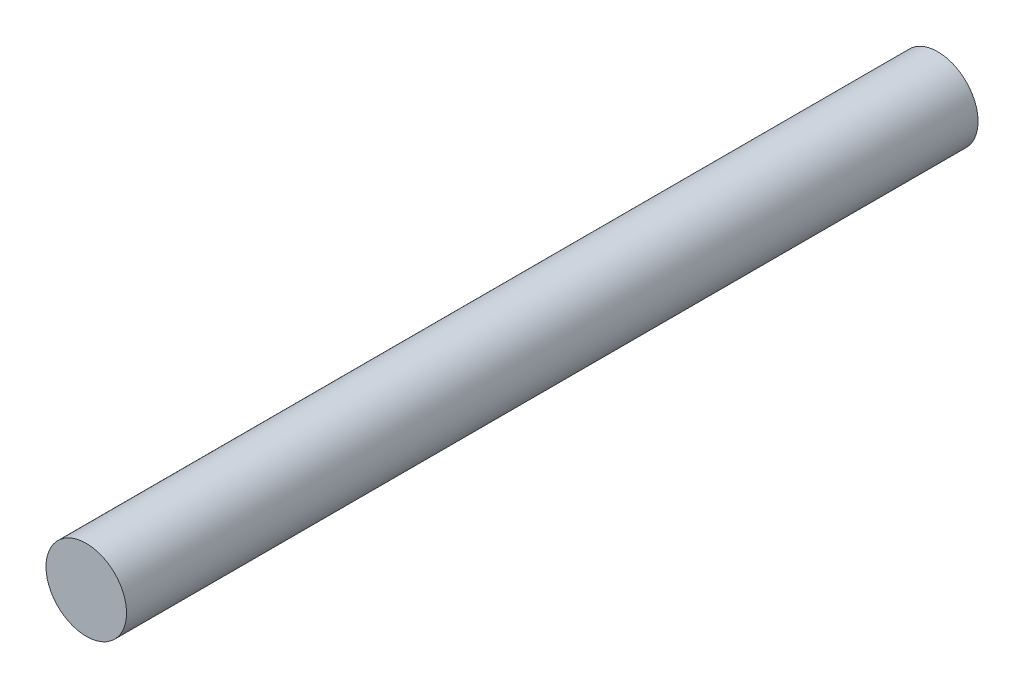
ISO-10303-21;
HEADER;
FILE_DESCRIPTION(('STEP AP214'),'2;1');
FILE_NAME('part.step','',(''),(''),'','','');
FILE_SCHEMA(('AUTOMOTIVE_DESIGN { 1 0 10303 214 1 1 1 1 }'));
ENDSEC;
DATA;
#1=APPLICATION_CONTEXT('core data for automotive mechanical design processes');
#2=APPLICATION_PROTOCOL_DEFINITION('international standard','automotive_design',2000,#1);
#3=PRODUCT_CONTEXT('',#1,'mechanical');
#4=PRODUCT('Part','Part','',(#3));
#5=PRODUCT_RELATED_PRODUCT_CATEGORY('part','',(#4));
#6=PRODUCT_DEFINITION_FORMATION('','',#4);
#7=PRODUCT_DEFINITION_CONTEXT('part definition',#1,'design');
#8=PRODUCT_DEFINITION('design','',#6,#7);
#9=PRODUCT_DEFINITION_SHAPE('','',#8);
#10=(LENGTH_UNIT() NAMED_UNIT(*) SI_UNIT(.MILLI.,.METRE.));
#11=(NAMED_UNIT(*) PLANE_ANGLE_UNIT() SI_UNIT($,.RADIAN.));
#12=(NAMED_UNIT(*) SI_UNIT($,.STERADIAN.) SOLID_ANGLE_UNIT());
#13=UNCERTAINTY_MEASURE_WITH_UNIT(LENGTH_MEASURE(1.E-05),#10,'distance_accuracy_value','');
#14=(GEOMETRIC_REPRESENTATION_CONTEXT(3) GLOBAL_UNCERTAINTY_ASSIGNED_CONTEXT((#13)) GLOBAL_UNIT_ASSIGNED_CONTEXT((#10,
#11,#12)) REPRESENTATION_CONTEXT('',''));
#15=CARTESIAN_POINT('',(0.,0.,0.));
#16=DIRECTION('',(0.,0.,1.));
#17=DIRECTION('',(1.,0.,0.));
#18=AXIS2_PLACEMENT_3D('',#15,#16,#17);
#19=CARTESIAN_POINT('',(0.,0.,60.96));
#20=DIRECTION('',(0.,0.,-1.));
#21=DIRECTION('',(-1.,0.,0.));
#22=AXIS2_PLACEMENT_3D('',#19,#20,#21);
#23=CYLINDRICAL_SURFACE('',#22,2.8829);
#24=CARTESIAN_POINT('',(0.,0.,60.96));
#25=DIRECTION('',(0.,0.,1.));
#26=DIRECTION('',(1.,0.,0.));
#27=AXIS2_PLACEMENT_3D('',#24,#25,#26);
#28=CIRCLE('',#27,2.8829);
#29=CARTESIAN_POINT('',(-2.8829,0.,60.96));
#30=VERTEX_POINT('',#29);
#31=EDGE_CURVE('E10',#30,#30,#28,.T.);
#32=CARTESIAN_POINT('',(0.,0.,0.));
#33=DIRECTION('',(0.,0.,1.));
#34=DIRECTION('',(1.,0.,0.));
#35=AXIS2_PLACEMENT_3D('',#32,#33,#34);
#36=CIRCLE('',#35,2.8829);
#37=CARTESIAN_POINT('',(-2.8829,0.,0.));
#38=VERTEX_POINT('',#37);
#39=EDGE_CURVE('E38',#38,#38,#36,.T.);
#40=CARTESIAN_POINT('',(-2.8829,0.,60.96));
#41=CARTESIAN_POINT('',(-2.8829,0.,60.325));
#42=CARTESIAN_POINT('',(-2.8829,0.,59.69));
#43=CARTESIAN_POINT('',(-2.8829,0.,58.42));
#44=CARTESIAN_POINT('',(-2.8829,0.,57.785));
#45=CARTESIAN_POINT('',(-2.8829,0.,56.515));
#46=CARTESIAN_POINT('',(-2.8829,0.,55.88));
#47=CARTESIAN_POINT('',(-2.8829,0.,54.61));
#48=CARTESIAN_POINT('',(-2.8829,0.,53.975));
#49=CARTESIAN_POINT('',(-2.8829,0.,52.705));
#50=CARTESIAN_POINT('',(-2.8829,0.,52.07));
#51=CARTESIAN_POINT('',(-2.8829,0.,50.8));
#52=CARTESIAN_POINT('',(-2.8829,0.,50.165));
#53=CARTESIAN_POINT('',(-2.8829,0.,48.895));
#54=CARTESIAN_POINT('',(-2.8829,0.,48.26));
#55=CARTESIAN_POINT('',(-2.8829,0.,46.99));
#56=CARTESIAN_POINT('',(-2.8829,0.,46.355));
#57=CARTESIAN_POINT('',(-2.8829,0.,45.085));
#58=CARTESIAN_POINT('',(-2.8829,0.,44.45));
#59=CARTESIAN_POINT('',(-2.8829,0.,43.18));
#60=CARTESIAN_POINT('',(-2.8829,0.,42.545));
#61=CARTESIAN_POINT('',(-2.8829,0.,41.275));
#62=CARTESIAN_POINT('',(-2.8829,0.,40.64));
#63=CARTESIAN_POINT('',(-2.8829,0.,39.37));
#64=CARTESIAN_POINT('',(-2.8829,0.,38.735));
#65=CARTESIAN_POINT('',(-2.8829,0.,37.465));
#66=CARTESIAN_POINT('',(-2.8829,0.,36.83));
#67=CARTESIAN_POINT('',(-2.8829,0.,35.56));
#68=CARTESIAN_POINT('',(-2.8829,0.,34.925));
#69=CARTESIAN_POINT('',(-2.8829,0.,33.655));
#70=CARTESIAN_POINT('',(-2.8829,0.,33.02));
#71=CARTESIAN_POINT('',(-2.8829,0.,31.75));
#72=CARTESIAN_POINT('',(-2.8829,0.,31.115));
#73=CARTESIAN_POINT('',(-2.8829,0.,29.845));
#74=CARTESIAN_POINT('',(-2.8829,0.,29.21));
#75=CARTESIAN_POINT('',(-2.8829,0.,27.94));
#76=CARTESIAN_POINT('',(-2.8829,0.,27.305));
#77=CARTESIAN_POINT('',(-2.8829,0.,26.035));
#78=CARTESIAN_POINT('',(-2.8829,0.,25.4));
#79=CARTESIAN_POINT('',(-2.8829,0.,24.13));
#80=CARTESIAN_POINT('',(-2.8829,0.,23.495));
#81=CARTESIAN_POINT('',(-2.8829,0.,22.225));
#82=CARTESIAN_POINT('',(-2.8829,0.,21.59));
#83=CARTESIAN_POINT('',(-2.8829,0.,20.32));
#84=CARTESIAN_POINT('',(-2.8829,0.,19.685));
#85=CARTESIAN_POINT('',(-2.8829,0.,18.415));
#86=CARTESIAN_POINT('',(-2.8829,0.,17.78));
#87=CARTESIAN_POINT('',(-2.8829,0.,16.51));
#88=CARTESIAN_POINT('',(-2.8829,0.,15.875));
#89=CARTESIAN_POINT('',(-2.8829,0.,14.605));
#90=CARTESIAN_POINT('',(-2.8829,0.,13.97));
#91=CARTESIAN_POINT('',(-2.8829,0.,12.7));
#92=CARTESIAN_POINT('',(-2.8829,0.,12.065));
#93=CARTESIAN_POINT('',(-2.8829,0.,10.795));
#94=CARTESIAN_POINT('',(-2.8829,0.,10.16));
#95=CARTESIAN_POINT('',(-2.8829,0.,8.89));
#96=CARTESIAN_POINT('',(-2.8829,0.,8.255));
#97=CARTESIAN_POINT('',(-2.8829,0.,6.985));
#98=CARTESIAN_POINT('',(-2.8829,0.,6.35));
#99=CARTESIAN_POINT('',(-2.8829,0.,5.08));
#100=CARTESIAN_POINT('',(-2.8829,0.,4.445));
#101=CARTESIAN_POINT('',(-2.8829,0.,3.175));
#102=CARTESIAN_POINT('',(-2.8829,0.,2.54));
#103=CARTESIAN_POINT('',(-2.8829,0.,1.27));
#104=CARTESIAN_POINT('',(-2.8829,0.,0.634999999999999));
#105=CARTESIAN_POINT('',(-2.8829,0.,0.));
#106=B_SPLINE_CURVE_WITH_KNOTS('',3,(#40,#41,#42,#43,#44,#45,#46,#47,#48,#49,#50,#51,#52,#53,
#54,#55,#56,#57,#58,#59,#60,#61,#62,#63,#64,#65,#66,#67,#68,#69,#70,#71,#72,#73,#74,#75,#76,#77,
#78,#79,#80,#81,#82,#83,#84,#85,#86,#87,#88,#89,#90,#91,#92,#93,#94,#95,#96,#97,#98,#99,#100,
#101,#102,#103,#104,#105),.UNSPECIFIED.,.F.,.F.,(4,2,2,2,2,2,2,2,2,2,2,2,2,2,2,2,2,2,2,2,2,2,2,
2,2,2,2,2,2,2,2,2,4),(0.,1.905,3.80999999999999,5.715,7.61999999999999,9.52499999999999,11.43,
13.335,15.24,17.145,19.05,20.955,22.86,24.765,26.67,28.575,30.48,32.385,34.29,36.195,38.1,
40.005,41.91,43.815,45.72,47.625,49.53,51.435,53.34,55.245,57.15,59.055,60.96),.UNSPECIFIED.);
#107=EDGE_CURVE('BSEAM35',#30,#38,#106,.T.);
#108=ORIENTED_EDGE('',*,*,#31,.F.);
#109=ORIENTED_EDGE('',*,*,#39,.T.);
#110=ORIENTED_EDGE('',*,*,#107,.T.);
#111=ORIENTED_EDGE('',*,*,#107,.F.);
#112=EDGE_LOOP('',(#108,#110,#109,#111));
#113=FACE_BOUND('',#112,.T.);
#114=ADVANCED_FACE('F35',(#113),#23,.T.);
#115=CARTESIAN_POINT('',(0.,0.,60.96));
#116=DIRECTION('',(0.,0.,1.));
#117=DIRECTION('',(1.,0.,0.));
#118=AXIS2_PLACEMENT_3D('',#115,#116,#117);
#119=PLANE('',#118);
#120=ORIENTED_EDGE('',*,*,#31,.T.);
#121=EDGE_LOOP('',(#120));
#122=FACE_BOUND('',#121,.T.);
#123=ADVANCED_FACE('F50',(#122),#119,.T.);
#124=CARTESIAN_POINT('',(0.,0.,0.));
#125=DIRECTION('',(0.,0.,1.));
#126=DIRECTION('',(1.,0.,0.));
#127=AXIS2_PLACEMENT_3D('',#124,#125,#126);
#128=PLANE('',#127);
#129=ORIENTED_EDGE('',*,*,#39,.F.);
#130=EDGE_LOOP('',(#129));
#131=FACE_BOUND('',#130,.T.);
#132=ADVANCED_FACE('F48',(#131),#128,.F.);
#133=CLOSED_SHELL('',(#114,#123,#132));
#134=MANIFOLD_SOLID_BREP('B2',#133);
#135=ADVANCED_BREP_SHAPE_REPRESENTATION('',(#18,#134),#14);
#136=SHAPE_DEFINITION_REPRESENTATION(#9,#135);
ENDSEC;
END-ISO-10303-21;
